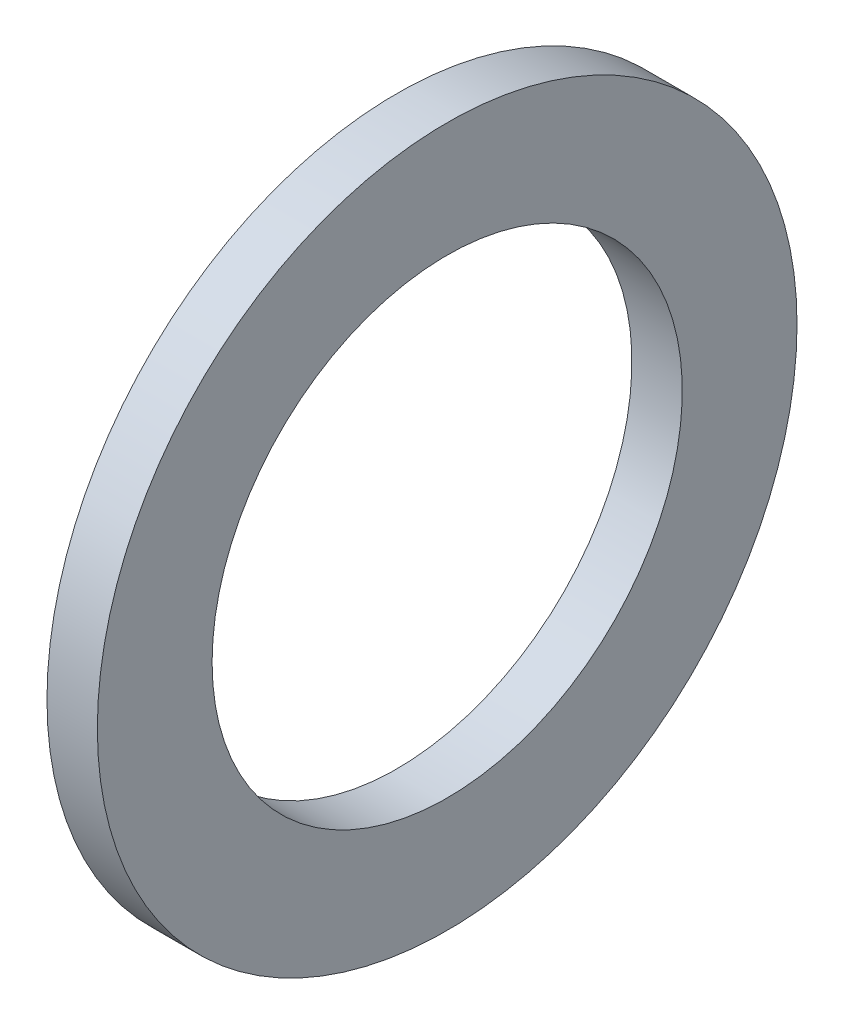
from build123d import *

# Parameters (mm, degrees)
SKETCH1_W = 18
SKETCH1_H = 41


with BuildPart() as part:
    # Sketch1 → Base-Revolve (revolve)
    with BuildSketch(Plane.XY, mode=Mode.PRIVATE) as base_revolve_sk:
        with Locations((-9, 104.5)):
            Rectangle(SKETCH1_W, SKETCH1_H)
    revolve(base_revolve_sk.sketch.rotate(Axis((-34.925, 0, 0), (1, 0, 0)), 90), axis=Axis((-34.925, 0, 0), (1, 0, 0)))


solid = part.part
